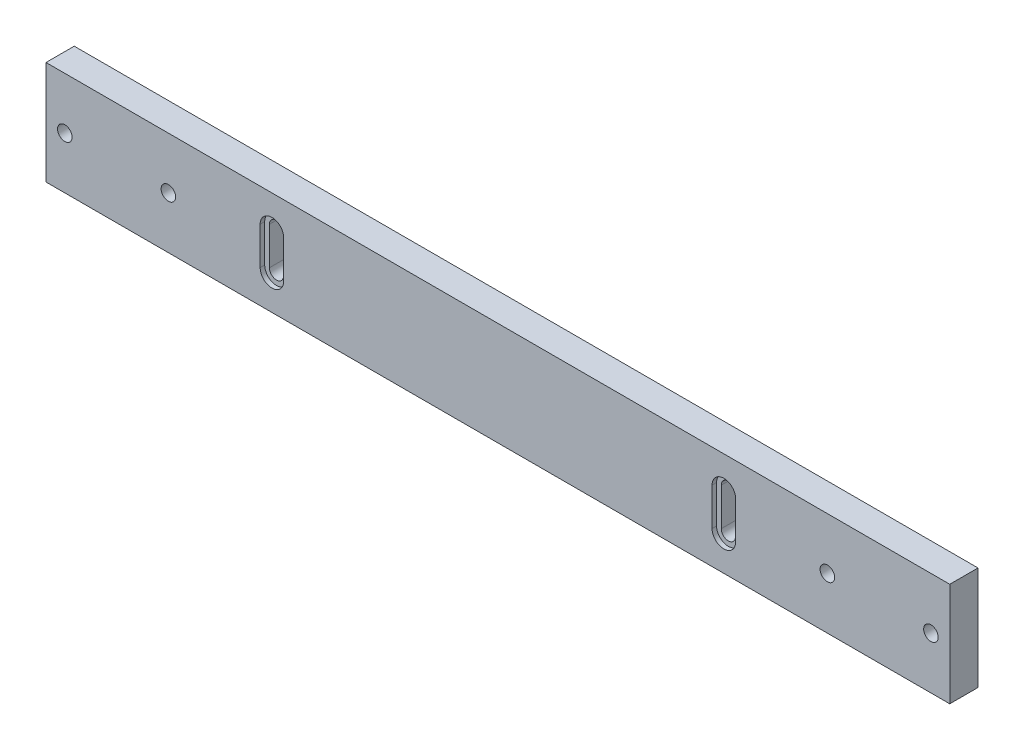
from build123d import *

# Parameters (mm, degrees)
SKETCH1_W                                        = 609.6
SKETCH1_H                                        = 69.85
BOSS_EXTRUDE1_DEPTH                              = 19.05
CBORE_FOR_3_8_SOCKET_HEAD_CAP_SCREW1_D           = 9.8044
CBORE_FOR_3_8_SOCKET_HEAD_CAP_SCREW1_CBORE_D     = 15.875
CBORE_FOR_3_8_SOCKET_HEAD_CAP_SCREW1_CBORE_DEPTH = 9.525
CUT_EXTRUDE1_DEPTH                               = 308.385260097
CUT_EXTRUDE2_DEPTH                               = 3.048


with BuildPart() as part:
    # Sketch1 → Boss-Extrude1 (new body)
    with BuildSketch(Plane.XY):
        Rectangle(SKETCH1_W, SKETCH1_H)
    extrude(amount=BOSS_EXTRUDE1_DEPTH)

    # CBORE for 3_8 Socket Head Cap Screw1 (through all)
    with Locations(Plane(origin=(0, 0, 0), x_dir=(-1, 0, 0), z_dir=(0, 0, -1))):
        with Locations((-292.1, 0), (-222.25, 0), (222.25, 0), (292.1, 0)):
            CounterBoreHole(CBORE_FOR_3_8_SOCKET_HEAD_CAP_SCREW1_D / 2, CBORE_FOR_3_8_SOCKET_HEAD_CAP_SCREW1_CBORE_D / 2, CBORE_FOR_3_8_SOCKET_HEAD_CAP_SCREW1_CBORE_DEPTH)

    # Sketch4 → Cut-Extrude1 (cut, through all)
    with BuildSketch(Plane.XY.offset(19.05)):
        with BuildLine():
            Line((-157.1625, 12.7), (-157.1625, -12.7))
            ThreePointArc((-157.1625, -12.7), (-152.4, -17.4625), (-147.6375, -12.7))
            Line((-147.6375, -12.7), (-147.6375, 12.7))
            ThreePointArc((-147.6375, 12.7), (-152.4, 17.4625), (-157.1625, 12.7))
        make_face()
    cut_extrude1 = extrude(amount=-CUT_EXTRUDE1_DEPTH, mode=Mode.SUBTRACT)

    # Sketch5 → Cut-Extrude2 (cut)
    with BuildSketch(Plane.XY.offset(19.05)):
        with BuildLine():
            Line((-160.3375, 12.7), (-160.3375, -12.7))
            ThreePointArc((-160.3375, -12.7), (-152.4, -20.6375), (-144.4625, -12.7))
            Line((-144.4625, -12.7), (-144.4625, 12.7))
            ThreePointArc((-144.4625, 12.7), (-152.4, 20.6375), (-160.3375, 12.7))
        make_face()
    cut_extrude2 = extrude(amount=-CUT_EXTRUDE2_DEPTH, mode=Mode.SUBTRACT)

    # Mirror1: Cut-Extrude1, Cut-Extrude2 across plane
    add(cut_extrude1.mirror(Plane(origin=(0, 0, 0), x_dir=(0, 0, 1), z_dir=(1, 0, 0))), mode=Mode.SUBTRACT)
    add(cut_extrude2.mirror(Plane(origin=(0, 0, 0), x_dir=(0, 0, 1), z_dir=(1, 0, 0))), mode=Mode.SUBTRACT)


solid = part.part
